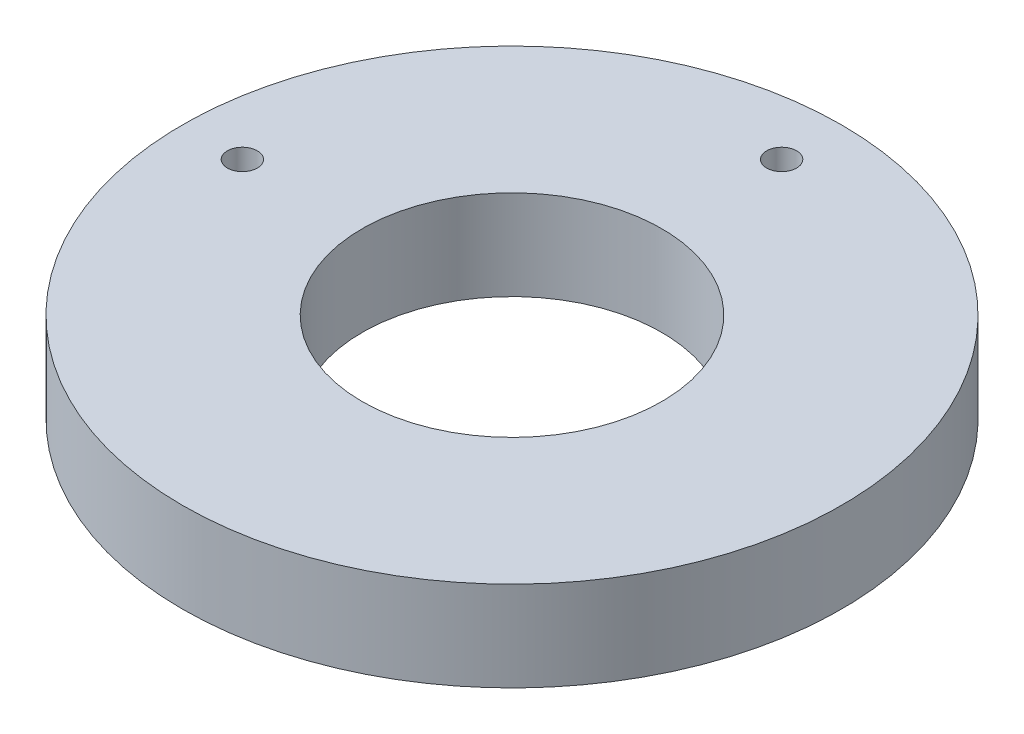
from build123d import *

# Parameters (mm, degrees)
SKETCH1_R           = 11
SKETCH1_R_2         = 5
BOSS_EXTRUDE1_DEPTH = 3
CUT_EXTRUDE1_REACH  = 17.843
SKETCH2_R           = 0.5


with BuildPart() as part:
    # Sketch1 → Boss-Extrude1 (new body)
    with BuildSketch(Plane(origin=(0, 0, 0), x_dir=(1, 0, 0), z_dir=(0, 1, 0))):
        with Locations(Location((0, 0, 0), (0, 0, 270))):
            Circle(SKETCH1_R)
        with Locations(Location((0, 0, 0), (0, 0, 270))):
            Circle(SKETCH1_R_2, mode=Mode.SUBTRACT)
    extrude(amount=BOSS_EXTRUDE1_DEPTH)

    # Sketch2 → Cut-Extrude1 (cut, up to next)
    with BuildSketch(Plane(origin=(0, 0, 0), x_dir=(1, 0, 0), z_dir=(0, 1, 0)), mode=Mode.PRIVATE) as cut_extrude1_sk1:
        with Locations(Location((-9, 0, 0), (0, 0, 270))):
            Circle(SKETCH2_R)
    cut_extrude1_tool1 = extrude(cut_extrude1_sk1.sketch, amount=CUT_EXTRUDE1_REACH, mode=Mode.PRIVATE) & part.part
    # Sketch2 → Cut-Extrude1 (cut, up to next)
    with BuildSketch(Plane(origin=(0, 0, 0), x_dir=(1, 0, 0), z_dir=(0, 1, 0)), mode=Mode.PRIVATE) as cut_extrude1_sk2:
        with Locations(Location((0, 9, 0), (0, 0, 270))):
            Circle(SKETCH2_R)
    cut_extrude1_tool2 = extrude(cut_extrude1_sk2.sketch, amount=CUT_EXTRUDE1_REACH, mode=Mode.PRIVATE) & part.part
    add(cut_extrude1_tool1.solids().sort_by_distance((-9, 0, 0))[0], mode=Mode.SUBTRACT)
    add(cut_extrude1_tool2.solids().sort_by_distance((0, 0, -9))[0], mode=Mode.SUBTRACT)


solid = part.part
